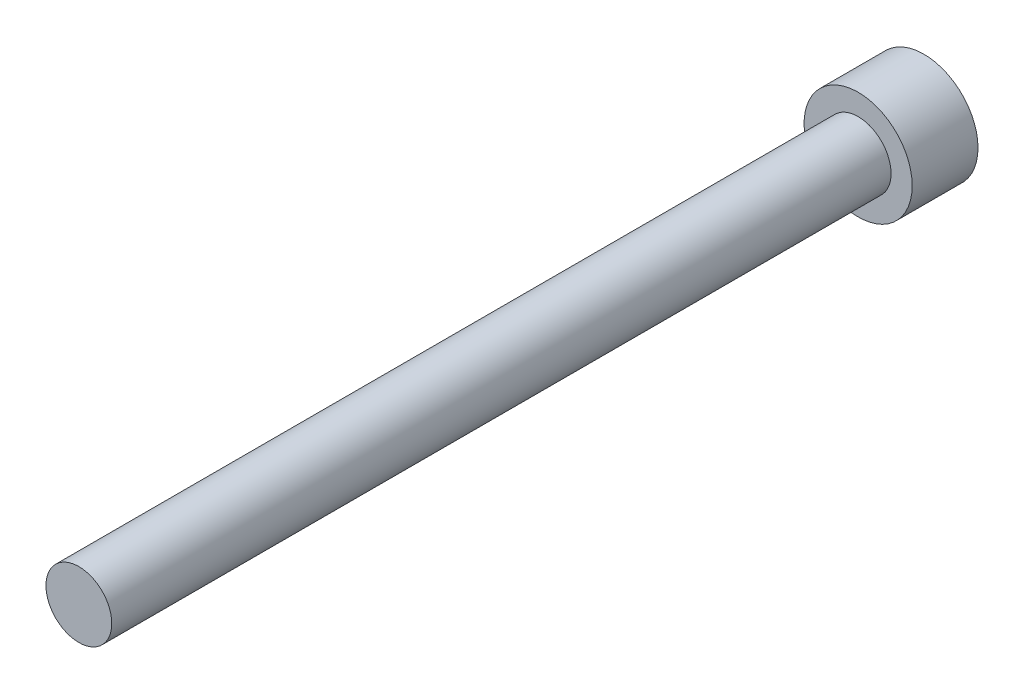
from build123d import *

# Parameters (mm, degrees)
HEX_2_DEPTH = 3.048


with BuildPart() as part:
    # Sketch6 → Revolve1 (revolve)
    with BuildSketch(Plane(origin=(0, 0, 0), x_dir=(0, 0, -1), z_dir=(1, 0, 0)), mode=Mode.PRIVATE) as revolve1_sk:
        Polygon((-57.15, 0), (-57.15, -2.413), (0, -2.413), (0, -3.9624), (4.826, -3.9624), (4.826, 0), align=None)
    revolve(revolve1_sk.sketch.rotate(Axis((0, 0, 57.15), (0, 0, -1)), 270), axis=Axis((0, 0, 57.15), (0, 0, -1)))

    # Sketch7 → HEX 2 (cut)
    with BuildSketch(Plane(origin=(0, 0, -4.826), x_dir=(-1, 0, 0), z_dir=(0, 0, -1))):
        Polygon((-1.9812, 1.143846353), (-1.9812, -1.143846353), (0, -2.287692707), (1.9812, -1.143846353), (1.9812, 1.143846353), (0, 2.287692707), align=None)
    extrude(amount=-HEX_2_DEPTH, mode=Mode.SUBTRACT)


solid = part.part
